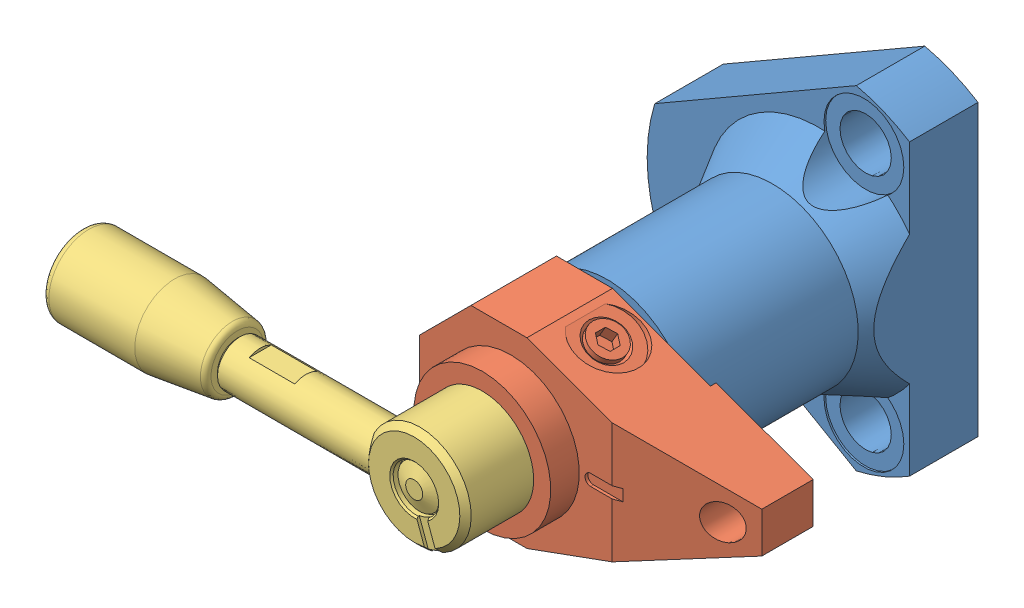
SolidWorks assembly QLSWW30L-100.sldasm, configuration Default (file format 15000). Lengths in mm.
Overall size (103.34 58.5 85.84).
3 component instances, 3 part files, 0 mates.
Components (placement in the parent):
- QLSWW30L-100_01-1: QLSWW30L-100_01.SLDPRT [ﾃﾞﾌｫﾙﾄ] x (0 1 0) z (1 0 0) size (58.5 49 46)
- QLSWW30L-100_02-1: QLSWW30L-100_02.SLDPRT [ﾃﾞﾌｫﾙﾄ] at (0 0 62.95) x (0 1 0) z (1 0 0) size (32 69.65 53)
- QLSWW30L-100_03-1: QLSWW30L-100_03.SLDPRT [ﾃﾞﾌｫﾙﾄ] at (0 0 59.8408) x (0.34202 -0.939693 0) z (-0.939693 -0.34202 0) size (36.53 40.55 69.58)
